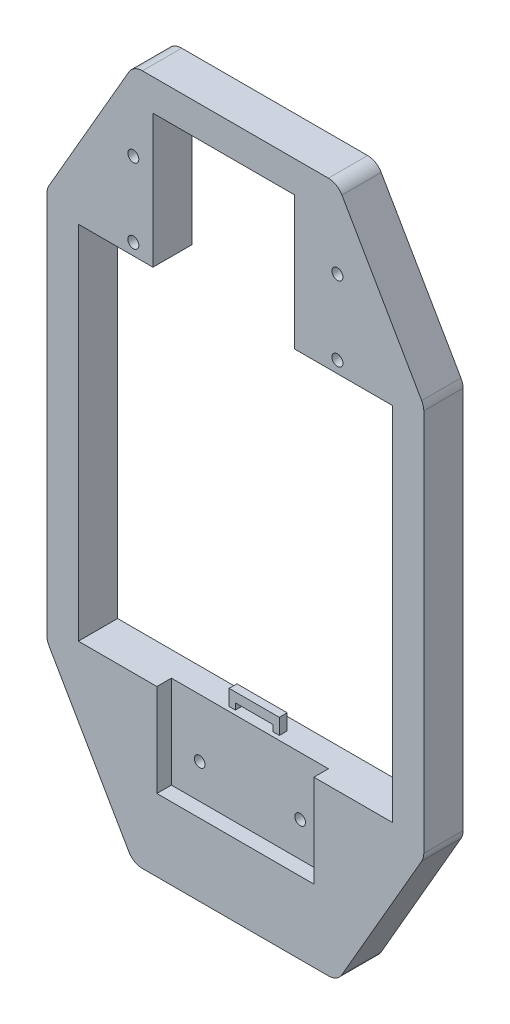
from build123d import *

# Parameters (mm, degrees)
EXTRUDE_1_DEPTH           = 30
EXTRUDE_2_DEPTH           = 40
MIRROR_2_COPY_1_DEPTH     = 40
EXTRUDE_START             = 20
SKETCH_3_W                = 200
SKETCH_3_H                = 230
EXTRUDE_3_DEPTH           = 20
EXTRUDE_START_2           = -10
EXTRUDE_11_DEPTH          = 15
FILLET_3_R                = 5
SKETCH_6_W                = 22
SKETCH_6_H                = 22
EXTRUDE_12_DEPTH          = 225
M8X1_0_1_AT_2_COUNT       = 2
M8X1_0_1_AT_2_PITCH       = 47.5
SKETCH_14_W               = 75
SKETCH_14_H               = 1
CUT_EXTRUDE_1_DEPTH       = 10
SKETCH_15_W               = 6
SKETCH_15_H               = 6
CUT_EXTRUDE_2_DEPTH       = 10
PATTERN_LINEAR_1_COUNT    = 2
PATTERN_LINEAR_1_PITCH    = 30
EXTRUDE_START_3           = -21
EXTRUDE_13_DEPTH          = 20
CUT_EXTRUDE_3_DEPTH       = 20
FILLET_4_R                = 5
SKETCH_18_W               = 4
SKETCH_18_H               = 8
CUT_EXTRUDE_4_DEPTH       = 100
MIRROR_9_COPY_1_SKETCH_W  = 6
MIRROR_9_COPY_1_SKETCH_H  = 6
MIRROR_9_COPY_1_DEPTH     = 10
MIRROR_11_COPY_1_SKETCH_W = 6
MIRROR_11_COPY_1_SKETCH_H = 6
MIRROR_11_COPY_1_DEPTH    = 10
MIRROR_11_COPY_2_SKETCH_W = 6
MIRROR_11_COPY_2_SKETCH_H = 6
MIRROR_11_COPY_2_DEPTH    = 10
MIRROR_11_COPY_3_SKETCH_W = 4
MIRROR_11_COPY_3_SKETCH_H = 8
MIRROR_11_COPY_3_DEPTH    = 100
MIRROR_11_COPY_4_SKETCH_W = 6
MIRROR_11_COPY_4_SKETCH_H = 6
MIRROR_11_COPY_4_DEPTH    = 10
EXTRUDE_14_REACH          = 388.297
EXTRUDE_START_4           = 12
SKETCH_20_W               = 200
SKETCH_20_H               = 230
EXTRUDE_15_DEPTH          = 12
CUT_EXTRUDE_5_DEPTH       = 20
SKETCH_24_W               = 75
SKETCH_24_H               = 85
EXTRUDE_16_DEPTH          = 30
HOLE_WIZARD_M8_1_D        = 6.8
HOLE_WIZARD_M8_1_DEPTH    = 20
HOLE_WIZARD_M8_1_TIP      = 2.042926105
EXTRUDE_START_5           = -12
EXTRUDE_17_DEPTH          = 5
PATTERN_LINEAR_2_COUNT    = 2
PATTERN_LINEAR_2_PITCH    = 26
HOLE_WIZARD_M8_2_D        = 6.8
HOLE_WIZARD_M8_2_DEPTH    = 22.5
HOLE_WIZARD_M8_2_TIP      = 2.042926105
EXTRUDE_18_DEPTH          = 135.736479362
FILLET_5_R                = 10
SKETCH_31_R               = 5
CUT_EXTRUDE_6_DEPTH       = 10
SKETCH_32_W               = 15
SKETCH_32_H               = 85
CUT_EXTRUDE_7_DEPTH       = 30
SKETCH_33_W               = 90
SKETCH_33_H               = 85
CUT_EXTRUDE_8_DEPTH       = 12
SKETCH_34_W               = 100
SKETCH_34_H               = 59
CUT_EXTRUDE_9_DEPTH       = 9.25
CUT_EXTRUDE_START         = -132.5
SKETCH_35_W               = 527.627880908
SKETCH_35_H               = 677.917974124
CUT_EXTRUDE_11_DEPTH      = 132.5


with BuildPart() as part:
    # Sketch 1 → Extrude 1 (new body)
    with BuildSketch(Plane.XY):
        with BuildLine():
            Line((-118.660254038, 127.025650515), (-67.868239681, 215))
            ThreePointArc((-67.868239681, 215), (-64.207985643, 218.660254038), (-59.207985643, 220))
            Line((-59.207985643, 220), (59.207985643, 220))
            ThreePointArc((59.207985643, 220), (64.207985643, 218.660254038), (67.868239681, 215))
            Line((67.868239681, 215), (118.660254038, 127.025650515))
            ThreePointArc((118.660254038, 127.025650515), (119.659258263, 124.613840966), (120, 122.025650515))
            Line((120, 122.025650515), (120, -122.025650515))
            ThreePointArc((120, -122.025650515), (119.659258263, -124.613840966), (118.660254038, -127.025650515))
            Line((118.660254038, -127.025650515), (67.868239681, -215))
            ThreePointArc((67.868239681, -215), (64.207985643, -218.660254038), (59.207985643, -220))
            Line((59.207985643, -220), (-59.207985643, -220))
            ThreePointArc((-59.207985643, -220), (-64.207985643, -218.660254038), (-67.868239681, -215))
            Line((-67.868239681, -215), (-118.660254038, -127.025650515))
            ThreePointArc((-118.660254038, -127.025650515), (-119.659258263, -124.613840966), (-120, -122.025650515))
            Line((-120, -122.025650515), (-120, 122.025650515))
            ThreePointArc((-120, 122.025650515), (-119.659258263, 124.613840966), (-118.660254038, 127.025650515))
        make_face()
        with BuildLine():
            Line((-98.660254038, 121.666666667), (-56.321234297, 195))
            ThreePointArc((-56.321234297, 195), (-52.660980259, 198.660254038), (-47.660980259, 200))
            Line((-47.660980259, 200), (47.660980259, 200))
            ThreePointArc((47.660980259, 200), (52.660980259, 198.660254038), (56.321234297, 195))
            Line((56.321234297, 195), (98.660254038, 121.666666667))
            ThreePointArc((98.660254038, 121.666666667), (99.659258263, 119.254857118), (100, 116.666666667))
            Line((100, 116.666666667), (100, -116.666666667))
            ThreePointArc((100, -116.666666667), (99.659258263, -119.254857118), (98.660254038, -121.666666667))
            Line((98.660254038, -121.666666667), (56.321234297, -195))
            ThreePointArc((56.321234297, -195), (52.660980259, -198.660254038), (47.660980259, -200))
            Line((47.660980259, -200), (-47.660980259, -200))
            ThreePointArc((-47.660980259, -200), (-52.660980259, -198.660254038), (-56.321234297, -195))
            Line((-56.321234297, -195), (-98.660254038, -121.666666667))
            ThreePointArc((-98.660254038, -121.666666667), (-99.659258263, -119.254857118), (-100, -116.666666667))
            Line((-100, -116.666666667), (-100, 116.666666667))
            ThreePointArc((-100, 116.666666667), (-99.659258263, 119.254857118), (-98.660254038, 121.666666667))
        make_face(mode=Mode.SUBTRACT)
    extrude(amount=EXTRUDE_1_DEPTH)

    # Sketch 2 → Extrude 2 (add)
    with BuildSketch(Plane.XY.offset(30)):
        Polygon((-100, 130), (-70, 130), (-70, 200), (-37.5, 200), (-37.5, 115), (-100, 115), align=None)
    extrude_2 = extrude(amount=-EXTRUDE_2_DEPTH)

    # Mirror 1: Extrude 2 across plane
    add(extrude_2.mirror(Plane.ZX))

    # Mirror 2: Extrude 2 across plane
    add(extrude_2.mirror(Plane(origin=(0, 0, 0), x_dir=(0, 0, 1), z_dir=(1, 0, 0))))

    # Mirror 2 copy 1 sketch → Mirror 2 copy 1 (add)
    with BuildSketch(Plane(origin=(0, 0, 30), x_dir=(-1, 0, 0), z_dir=(0, 0, 1))):
        Polygon((-100, 130), (-70, 130), (-70, 200), (-37.5, 200), (-37.5, 115), (-100, 115), align=None)
    extrude(amount=-MIRROR_2_COPY_1_DEPTH)

    # Sketch 3 → Extrude 3 (add)
    with BuildSketch(Plane(origin=(0, 0, 0), x_dir=(-1, 0, 0), z_dir=(0, 0, -1)).offset(EXTRUDE_START)):
        with BuildLine():
            Line((120, -122.025650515), (120, 122.025650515))
            ThreePointArc((120, 122.025650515), (119.659258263, 124.613840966), (118.660254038, 127.025650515))
            Line((118.660254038, 127.025650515), (67.868239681, 215))
            ThreePointArc((67.868239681, 215), (64.207985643, 218.660254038), (59.207985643, 220))
            Line((59.207985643, 220), (-59.207985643, 220))
            ThreePointArc((-59.207985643, 220), (-64.207985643, 218.660254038), (-67.868239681, 215))
            Line((-67.868239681, 215), (-118.660254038, 127.025650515))
            ThreePointArc((-118.660254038, 127.025650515), (-119.659258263, 124.613840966), (-120, 122.025650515))
            Line((-120, 122.025650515), (-120, -122.025650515))
            ThreePointArc((-120, -122.025650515), (-119.659258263, -124.613840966), (-118.660254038, -127.025650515))
            Line((-118.660254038, -127.025650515), (-67.868239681, -215))
            ThreePointArc((-67.868239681, -215), (-64.207985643, -218.660254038), (-59.207985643, -220))
            Line((-59.207985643, -220), (59.207985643, -220))
            ThreePointArc((59.207985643, -220), (64.207985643, -218.660254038), (67.868239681, -215))
            Line((67.868239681, -215), (118.660254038, -127.025650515))
            ThreePointArc((118.660254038, -127.025650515), (119.659258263, -124.613840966), (120, -122.025650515))
        make_face()
        Rectangle(SKETCH_3_W, SKETCH_3_H, mode=Mode.SUBTRACT)
    extrude(amount=-EXTRUDE_3_DEPTH)

    # Sketch 5 → Extrude 11 (add)
    with BuildSketch(Plane(origin=(0, 0, -20), x_dir=(-1, 0, 0), z_dir=(0, 0, -1)).offset(EXTRUDE_START_2)):
        with BuildLine():
            Line((-67.868239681, 215), (-67.868239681, 310))
            Line((-67.868239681, 310), (67.868239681, 310))
            Line((67.868239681, 310), (67.868239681, 215))
            ThreePointArc((67.868239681, 215), (64.207985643, 218.660254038), (59.207985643, 220))
            Line((59.207985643, 220), (-59.207985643, 220))
            ThreePointArc((-59.207985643, 220), (-64.207985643, 218.660254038), (-67.868239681, 215))
        make_face()
    extrude_11 = extrude(amount=-EXTRUDE_11_DEPTH)

    # Fillet 3
    fillet_3_edges = [part.edges().sort_by_distance(p)[0] for p in [
        (67.868239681, 310, -2.5),
        (-67.868239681, 310, -2.5),
    ]]
    fillet(fillet_3_edges, radius=FILLET_3_R)

    # Sketch 6 → Extrude 12 (add, symmetric)
    with BuildSketch(Plane(origin=(0, 0, 0), x_dir=(0, 0, -1), z_dir=(1, 0, 0))):
        with Locations((6, 210)):
            Rectangle(SKETCH_6_W, SKETCH_6_H)
    extrude_12 = extrude(amount=EXTRUDE_12_DEPTH, both=True)

    # Sketch 11 → M8x1.0 _1 (revolve, cut)
    with BuildSketch(Plane(origin=(-65, 122.5, 30), x_dir=(0, -1, 0), z_dir=(1, 0, 0))):
        Polygon((0, 0), (0, 23.103012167), (3.5, 21), (3.5, 0), align=None)
    m8x1_0_1 = revolve(axis=Axis((-65, 122.5, 36.35), (0, 0, -1)), mode=Mode.SUBTRACT)

    # M8x1.0 _1 at 2: M8x1.0 _1 ×2
    with Locations(*[(0, i * M8X1_0_1_AT_2_PITCH, 0) for i in range(1, M8X1_0_1_AT_2_COUNT)]):
        add(m8x1_0_1, mode=Mode.SUBTRACT)

    # Mirror 7: M8x1.0 _1 across plane
    add(m8x1_0_1.mirror(Plane(origin=(0, 0, 0), x_dir=(0, 0, 1), z_dir=(1, 0, 0))), mode=Mode.SUBTRACT)

    # Mirror 7 copy 1 sketch → Mirror 7 copy 1 (revolve, cut)
    with BuildSketch(Plane(origin=(65, 170, 30), x_dir=(0, -1, 0), z_dir=(-1, 0, 0))):
        Polygon((0, 0), (0, -23.103012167), (3.5, -21), (3.5, 0), align=None)
    revolve(axis=Axis((65, 170, 36.35), (0, 0, 1)), mode=Mode.SUBTRACT)

    # Sketch 14 → Cut-Extrude 1 (cut)
    with BuildSketch(Plane.XY):
        with Locations((0, 199.5)):
            Rectangle(SKETCH_14_W, SKETCH_14_H)
    cut_extrude_1 = extrude(amount=CUT_EXTRUDE_1_DEPTH, mode=Mode.SUBTRACT)

    # Mirror 8: Extrude 11, Extrude 12, Cut-Extrude 1 across plane
    add(extrude_11.mirror(Plane.ZX))
    add(extrude_12.mirror(Plane.ZX))
    add(cut_extrude_1.mirror(Plane.ZX), mode=Mode.SUBTRACT)

    # Sketch 15 → Cut-Extrude 2 (cut)
    with BuildSketch(Plane.XY.offset(5)):
        with Locations((191, 210)):
            Rectangle(SKETCH_15_W, SKETCH_15_H)
        with Locations((176, 210)):
            Rectangle(SKETCH_15_W, SKETCH_15_H)
    cut_extrude_2 = extrude(amount=-CUT_EXTRUDE_2_DEPTH, mode=Mode.SUBTRACT)

    # Pattern Linear 1: Cut-Extrude 2 ×2
    with Locations(*[(-i * PATTERN_LINEAR_1_PITCH, 0, 0) for i in range(1, PATTERN_LINEAR_1_COUNT)]):
        add(cut_extrude_2, mode=Mode.SUBTRACT)

    # Sketch 16 → Extrude 13 (add)
    with BuildSketch(Plane.XY.offset(5).offset(EXTRUDE_START_3)):
        with BuildLine():
            Line((135, 199), (135, -199))
            Line((135, -199), (77.105843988, -199))
            Line((77.105843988, -199), (118.660254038, -127.025650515))
            ThreePointArc((118.660254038, -127.025650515), (119.659258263, -124.613840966), (120, -122.025650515))
            Line((120, -122.025650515), (120, 122.025650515))
            ThreePointArc((120, 122.025650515), (119.659258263, 124.613840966), (118.660254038, 127.025650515))
            Line((118.660254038, 127.025650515), (77.105843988, 199))
            Line((77.105843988, 199), (135, 199))
        make_face()
        with BuildLine():
            Line((-135, 199), (-77.105843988, 199))
            Line((-77.105843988, 199), (-118.660254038, 127.025650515))
            ThreePointArc((-118.660254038, 127.025650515), (-119.659258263, 124.613840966), (-120, 122.025650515))
            Line((-120, 122.025650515), (-120, -122.025650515))
            ThreePointArc((-120, -122.025650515), (-119.659258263, -124.613840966), (-118.660254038, -127.025650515))
            Line((-118.660254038, -127.025650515), (-77.105843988, -199))
            Line((-77.105843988, -199), (-135, -199))
            Line((-135, -199), (-135, 199))
        make_face()
    extrude(amount=EXTRUDE_13_DEPTH)

    # Sketch 17 → Cut-Extrude 3 (cut)
    with BuildSketch(Plane.XY.offset(4)):
        Polygon((105.973357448, 199), (135, 148.724380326), (135, 199), align=None)
        Polygon((135, -199), (105.973357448, -199), (135, -148.724380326), align=None)
        Polygon((-105.973357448, -199), (-135, -148.724380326), (-135, -199), align=None)
        Polygon((-135, 199), (-105.973357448, 199), (-135, 148.724380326), align=None)
    extrude(amount=-CUT_EXTRUDE_3_DEPTH, mode=Mode.SUBTRACT)

    # Fillet 4
    fillet_4_edges = [part.edges().sort_by_distance(p)[0] for p in [
        (-135, 148.724380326, -6),
        (-105.973357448, 199, -6),
        (-105.973357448, -199, -6),
        (-135, -148.724380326, -6),
        (135, -148.724380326, -6),
        (105.973357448, -199, -6),
        (105.973357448, 199, -6),
        (135, 148.724380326, -6),
    ]]
    fillet(fillet_4_edges, radius=FILLET_4_R)

    # Sketch 18 → Cut-Extrude 4 (cut)
    with BuildSketch(Plane(origin=(225, 0, 0), x_dir=(0, 0, -1), z_dir=(1, 0, 0))):
        with Locations((6, 199)):
            Rectangle(SKETCH_18_W, SKETCH_18_H)
    cut_extrude_4 = extrude(amount=-CUT_EXTRUDE_4_DEPTH, mode=Mode.SUBTRACT)

    # Mirror 9: Cut-Extrude 2, Cut-Extrude 4 across plane
    add(cut_extrude_2.mirror(Plane.ZX), mode=Mode.SUBTRACT)
    add(cut_extrude_4.mirror(Plane.ZX), mode=Mode.SUBTRACT)

    # Mirror 9 copy 1 sketch → Mirror 9 copy 1 (cut)
    with BuildSketch(Plane(origin=(-30, 0, 5), x_dir=(1, 0, 0), z_dir=(0, 0, 1))):
        with Locations((191, -210)):
            Rectangle(MIRROR_9_COPY_1_SKETCH_W, MIRROR_9_COPY_1_SKETCH_H)
        with Locations((176, -210)):
            Rectangle(MIRROR_9_COPY_1_SKETCH_W, MIRROR_9_COPY_1_SKETCH_H)
    extrude(amount=-MIRROR_9_COPY_1_DEPTH, mode=Mode.SUBTRACT)

    # Mirror 11: Cut-Extrude 2, Cut-Extrude 4 across plane
    add(cut_extrude_2.mirror(Plane(origin=(0, 0, 0), x_dir=(0, 0, 1), z_dir=(1, 0, 0))), mode=Mode.SUBTRACT)
    add(cut_extrude_4.mirror(Plane(origin=(0, 0, 0), x_dir=(0, 0, 1), z_dir=(1, 0, 0))), mode=Mode.SUBTRACT)

    # Mirror 11 copy 1 sketch → Mirror 11 copy 1 (cut)
    with BuildSketch(Plane(origin=(30, 0, 5), x_dir=(-1, 0, 0), z_dir=(0, 0, 1))):
        with Locations((191, -210)):
            Rectangle(MIRROR_11_COPY_1_SKETCH_W, MIRROR_11_COPY_1_SKETCH_H)
        with Locations((176, -210)):
            Rectangle(MIRROR_11_COPY_1_SKETCH_W, MIRROR_11_COPY_1_SKETCH_H)
    extrude(amount=-MIRROR_11_COPY_1_DEPTH, mode=Mode.SUBTRACT)

    # Mirror 11 copy 2 sketch → Mirror 11 copy 2 (cut)
    with BuildSketch(Plane(origin=(0, 0, 5), x_dir=(-1, 0, 0), z_dir=(0, 0, 1))):
        with Locations((191, 210)):
            Rectangle(MIRROR_11_COPY_2_SKETCH_W, MIRROR_11_COPY_2_SKETCH_H)
        with Locations((176, 210)):
            Rectangle(MIRROR_11_COPY_2_SKETCH_W, MIRROR_11_COPY_2_SKETCH_H)
    extrude(amount=-MIRROR_11_COPY_2_DEPTH, mode=Mode.SUBTRACT)

    # Mirror 11 copy 3 sketch → Mirror 11 copy 3 (cut)
    with BuildSketch(Plane(origin=(-225, 0, 0), x_dir=(0, 0, -1), z_dir=(-1, 0, 0))):
        with Locations((6, 199)):
            Rectangle(MIRROR_11_COPY_3_SKETCH_W, MIRROR_11_COPY_3_SKETCH_H)
    extrude(amount=-MIRROR_11_COPY_3_DEPTH, mode=Mode.SUBTRACT)

    # Mirror 11 copy 4 sketch → Mirror 11 copy 4 (cut)
    with BuildSketch(Plane(origin=(30, 0, 5), x_dir=(-1, 0, 0), z_dir=(0, 0, 1))):
        with Locations((191, 210)):
            Rectangle(MIRROR_11_COPY_4_SKETCH_W, MIRROR_11_COPY_4_SKETCH_H)
        with Locations((176, 210)):
            Rectangle(MIRROR_11_COPY_4_SKETCH_W, MIRROR_11_COPY_4_SKETCH_H)
    extrude(amount=-MIRROR_11_COPY_4_DEPTH, mode=Mode.SUBTRACT)

    # Sketch 19 → Extrude 14 (add, up to next)
    with BuildSketch(Plane.XY.offset(30), mode=Mode.PRIVATE) as extrude_14_sk1:
        Polygon((-93.849001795, 130), (-70, 130), (-70, 171.307682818), align=None)
    extrude_14_tool1 = extrude(extrude_14_sk1.sketch, amount=-EXTRUDE_14_REACH, mode=Mode.PRIVATE) - part.part
    # Sketch 19 → Extrude 14 (add, up to next)
    with BuildSketch(Plane.XY.offset(30), mode=Mode.PRIVATE) as extrude_14_sk2:
        Polygon((93.849001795, 130), (70, 171.307682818), (70, 130), align=None)
    extrude_14_tool2 = extrude(extrude_14_sk2.sketch, amount=-EXTRUDE_14_REACH, mode=Mode.PRIVATE) - part.part
    # Sketch 19 → Extrude 14 (add, up to next)
    with BuildSketch(Plane.XY.offset(30), mode=Mode.PRIVATE) as extrude_14_sk3:
        Polygon((93.849001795, -130), (70, -130), (70, -171.307682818), align=None)
    extrude_14_tool3 = extrude(extrude_14_sk3.sketch, amount=-EXTRUDE_14_REACH, mode=Mode.PRIVATE) - part.part
    # Sketch 19 → Extrude 14 (add, up to next)
    with BuildSketch(Plane.XY.offset(30), mode=Mode.PRIVATE) as extrude_14_sk4:
        Polygon((-93.849001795, -130), (-70, -171.307682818), (-70, -130), align=None)
    extrude_14_tool4 = extrude(extrude_14_sk4.sketch, amount=-EXTRUDE_14_REACH, mode=Mode.PRIVATE) - part.part
    add(extrude_14_tool1.solids().sort_by_distance((-77.949667, 143.769228, 30))[0])
    add(extrude_14_tool2.solids().sort_by_distance((77.949667, 143.769228, 30))[0])
    add(extrude_14_tool3.solids().sort_by_distance((77.949667, -143.769228, 30))[0])
    add(extrude_14_tool4.solids().sort_by_distance((-77.949667, -143.769228, 30))[0])

    # Sketch 20 → Extrude 15 (add)
    with BuildSketch(Plane(origin=(0, 0, -20), x_dir=(-1, 0, 0), z_dir=(0, 0, -1)).offset(EXTRUDE_START_4)):
        with BuildLine():
            Line((120, -122.025650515), (120, 122.025650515))
            ThreePointArc((120, 122.025650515), (119.659258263, 124.613840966), (118.660254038, 127.025650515))
            Line((118.660254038, 127.025650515), (67.868239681, 215))
            ThreePointArc((67.868239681, 215), (64.207985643, 218.660254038), (59.207985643, 220))
            Line((59.207985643, 220), (-59.207985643, 220))
            ThreePointArc((-59.207985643, 220), (-64.207985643, 218.660254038), (-67.868239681, 215))
            Line((-67.868239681, 215), (-118.660254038, 127.025650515))
            ThreePointArc((-118.660254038, 127.025650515), (-119.659258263, 124.613840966), (-120, 122.025650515))
            Line((-120, 122.025650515), (-120, -122.025650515))
            ThreePointArc((-120, -122.025650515), (-119.659258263, -124.613840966), (-118.660254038, -127.025650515))
            Line((-118.660254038, -127.025650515), (-67.868239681, -215))
            ThreePointArc((-67.868239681, -215), (-64.207985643, -218.660254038), (-59.207985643, -220))
            Line((-59.207985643, -220), (59.207985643, -220))
            ThreePointArc((59.207985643, -220), (64.207985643, -218.660254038), (67.868239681, -215))
            Line((67.868239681, -215), (118.660254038, -127.025650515))
            ThreePointArc((118.660254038, -127.025650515), (119.659258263, -124.613840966), (120, -122.025650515))
        make_face()
        Rectangle(SKETCH_20_W, SKETCH_20_H, mode=Mode.SUBTRACT)
    extrude(amount=-EXTRUDE_15_DEPTH)

    # Sketch 22 → Cut-Extrude 5 (cut)
    with BuildSketch(Plane(origin=(67.868239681, 0, 0), x_dir=(0, 0, -1), z_dir=(1, 0, 0))):
        Polygon((0, 264), (10, 266), (10, 272), (0, 274), align=None)
        Polygon((0, 278), (10, 280), (10, 286), (0, 288), align=None)
    cut_extrude_5 = extrude(amount=-CUT_EXTRUDE_5_DEPTH, mode=Mode.SUBTRACT)

    # Mirror 12: Cut-Extrude 5 across plane
    add(cut_extrude_5.mirror(Plane(origin=(0, 0, 0), x_dir=(0, 0, 1), z_dir=(1, 0, 0))), mode=Mode.SUBTRACT)

    # Sketch 24 → Extrude 16 (add)
    with BuildSketch(Plane.XY):
        with Locations((0, -157.5)):
            Rectangle(SKETCH_24_W, SKETCH_24_H)
    extrude(amount=EXTRUDE_16_DEPTH)

    # Hole Wizard M8 _1
    with Locations(Plane(origin=(0, -115, -22), x_dir=(0, 0, 1), z_dir=(0, 1, 0))):
        with Locations((0, 0)):
            Hole(HOLE_WIZARD_M8_1_D / 2, depth=HOLE_WIZARD_M8_1_DEPTH)
            with Locations((0, 0, -(HOLE_WIZARD_M8_1_DEPTH + HOLE_WIZARD_M8_1_TIP / 2))):  # 118° drill point
                Cone(0, HOLE_WIZARD_M8_1_D / 2, HOLE_WIZARD_M8_1_TIP, mode=Mode.SUBTRACT)

    # Sketch 27 → Extrude 17 (add)
    with BuildSketch(Plane.XY.offset(30).offset(EXTRUDE_START_5)):
        Polygon((-16, -115), (-16, -105), (16, -105), (16, -115), (12, -115), (12, -111), (-12, -111), (-12, -115), align=None)
    extrude_17 = extrude(amount=-EXTRUDE_17_DEPTH)

    # Pattern Linear 2: Extrude 17 ×2
    with Locations(*[(0, 0, -i * PATTERN_LINEAR_2_PITCH) for i in range(1, PATTERN_LINEAR_2_COUNT)]):
        add(extrude_17)

    # Hole Wizard M8 _2
    with Locations(Plane(origin=(-32, -152, 30), x_dir=(1, 0, 0), z_dir=(0, 0, 1))):
        with Locations((0, 0), (64, 0)):
            Hole(HOLE_WIZARD_M8_2_D / 2, depth=HOLE_WIZARD_M8_2_DEPTH)
            with Locations((0, 0, -(HOLE_WIZARD_M8_2_DEPTH + HOLE_WIZARD_M8_2_TIP / 2))):  # 118° drill point
                Cone(0, HOLE_WIZARD_M8_2_D / 2, HOLE_WIZARD_M8_2_TIP, mode=Mode.SUBTRACT)

    # Sketch 30 → Extrude 18 (add)
    with BuildSketch(Plane.ZY.offset(67.868239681)):
        with BuildLine():
            Line((-10, -310), (-38.262993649, -300.579002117))
            ThreePointArc((-38.262993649, -300.579002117), (-47.62572503, -298.274752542), (-57.23665961, -297.5))
            Line((-57.23665961, -297.5), (-125, -297.5))
            ThreePointArc((-125, -297.5), (-126.767766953, -296.767766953), (-127.5, -295))
            Line((-127.5, -295), (-127.5, -290))
            ThreePointArc((-127.5, -290), (-126.767766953, -288.232233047), (-125, -287.5))
            Line((-125, -287.5), (-10, -287.5))
            Line((-10, -287.5), (-10, -310))
        make_face()
    extrude(amount=-EXTRUDE_18_DEPTH)

    # Fillet 5
    fillet_5_edges = [part.edges().sort_by_distance(p)[0] for p in [
        (0, -287.5, -10),
        (0, -310, -10),
    ]]
    fillet(fillet_5_edges, radius=FILLET_5_R)

    # Sketch 31 → Cut-Extrude 6 (cut)
    with BuildSketch(Plane.XZ.offset(297.5)):
        with Locations(Location((-45, -111.75, 0), (0, 0, 270))):
            Circle(SKETCH_31_R)
        with Locations(Location((45, -111.75, 0), (0, 0, 270))):
            Circle(SKETCH_31_R)
    extrude(amount=-CUT_EXTRUDE_6_DEPTH, mode=Mode.SUBTRACT)

    # Sketch 32 → Cut-Extrude 7 (cut)
    with BuildSketch(Plane.XY.offset(30)):
        with Locations((-45, 157.5)):
            Rectangle(SKETCH_32_W, SKETCH_32_H)
    extrude(amount=-CUT_EXTRUDE_7_DEPTH, mode=Mode.SUBTRACT)

    # Sketch 33 → Cut-Extrude 8 (cut)
    with BuildSketch(Plane.XY):
        with Locations((-7.5, 157.5)):
            Rectangle(SKETCH_33_W, SKETCH_33_H)
    extrude(amount=-CUT_EXTRUDE_8_DEPTH, mode=Mode.SUBTRACT)

    # Sketch 34 → Cut-Extrude 9 (cut)
    with BuildSketch(Plane.XY.offset(30)):
        with Locations((0, -144.5)):
            Rectangle(SKETCH_34_W, SKETCH_34_H)
    extrude(amount=-CUT_EXTRUDE_9_DEPTH, mode=Mode.SUBTRACT)

    # Sketch 35 → Cut-Extrude 11 (cut)
    with BuildSketch(Plane(origin=(0, 0, -127.5), x_dir=(-1, 0, 0), z_dir=(0, 0, -1)).offset(CUT_EXTRUDE_START)):
        Rectangle(SKETCH_35_W, SKETCH_35_H)
    extrude(amount=CUT_EXTRUDE_11_DEPTH, mode=Mode.SUBTRACT)


solid = part.part
